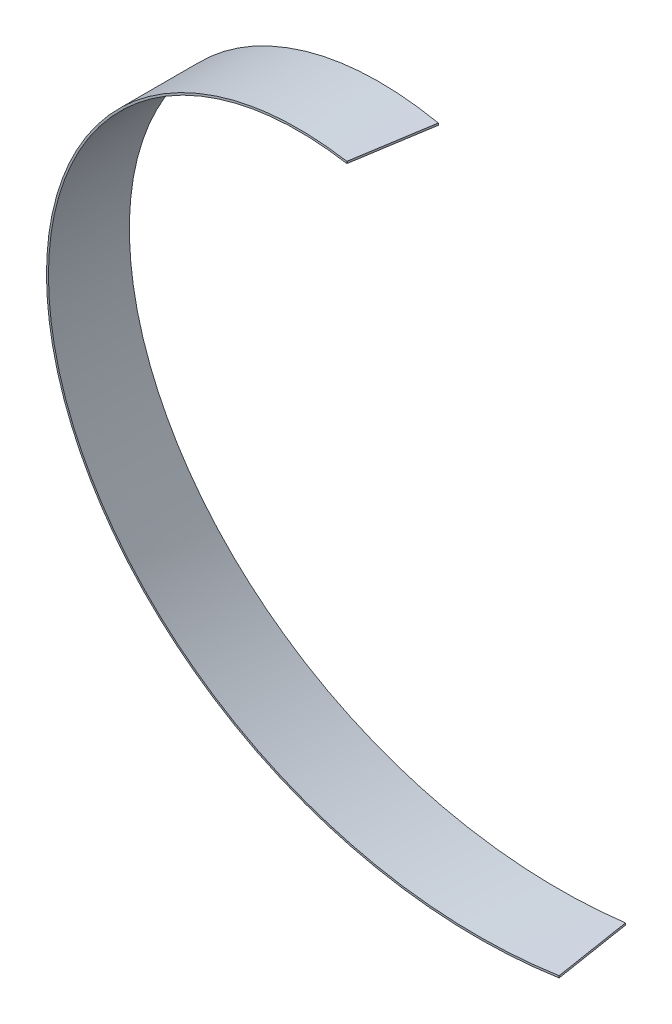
ISO-10303-21;
HEADER;
FILE_DESCRIPTION(('STEP AP214'),'2;1');
FILE_NAME('part.step','',(''),(''),'','','');
FILE_SCHEMA(('AUTOMOTIVE_DESIGN { 1 0 10303 214 1 1 1 1 }'));
ENDSEC;
DATA;
#1=APPLICATION_CONTEXT('core data for automotive mechanical design processes');
#2=APPLICATION_PROTOCOL_DEFINITION('international standard','automotive_design',2000,#1);
#3=PRODUCT_CONTEXT('',#1,'mechanical');
#4=PRODUCT('Part','Part','',(#3));
#5=PRODUCT_RELATED_PRODUCT_CATEGORY('part','',(#4));
#6=PRODUCT_DEFINITION_FORMATION('','',#4);
#7=PRODUCT_DEFINITION_CONTEXT('part definition',#1,'design');
#8=PRODUCT_DEFINITION('design','',#6,#7);
#9=PRODUCT_DEFINITION_SHAPE('','',#8);
#10=(LENGTH_UNIT() NAMED_UNIT(*) SI_UNIT(.MILLI.,.METRE.));
#11=(NAMED_UNIT(*) PLANE_ANGLE_UNIT() SI_UNIT($,.RADIAN.));
#12=(NAMED_UNIT(*) SI_UNIT($,.STERADIAN.) SOLID_ANGLE_UNIT());
#13=UNCERTAINTY_MEASURE_WITH_UNIT(LENGTH_MEASURE(1.E-05),#10,'distance_accuracy_value','');
#14=(GEOMETRIC_REPRESENTATION_CONTEXT(3) GLOBAL_UNCERTAINTY_ASSIGNED_CONTEXT((#13)) GLOBAL_UNIT_ASSIGNED_CONTEXT((#10,
#11,#12)) REPRESENTATION_CONTEXT('',''));
#15=CARTESIAN_POINT('',(0.,0.,0.));
#16=DIRECTION('',(0.,0.,1.));
#17=DIRECTION('',(1.,0.,0.));
#18=AXIS2_PLACEMENT_3D('',#15,#16,#17);
#19=CARTESIAN_POINT('',(-1.5717672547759,-99.75,-9.87570492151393));
#20=DIRECTION('',(-0.987570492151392,0.,0.15717672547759));
#21=DIRECTION('',(0.15717672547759,0.,0.987570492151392));
#22=AXIS2_PLACEMENT_3D('',#19,#20,#21);
#23=PLANE('',#22);
#24=DIRECTION('',(0.,1.,0.));
#25=VECTOR('',#24,1.);
#26=CARTESIAN_POINT('',(-1.5717672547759,-99.75,-9.87570492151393));
#27=LINE('',#26,#25);
#28=CARTESIAN_POINT('',(-1.5717672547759,-100.25,-9.87570492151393));
#29=VERTEX_POINT('',#28);
#30=CARTESIAN_POINT('',(-1.5717672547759,-99.75,-9.87570492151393));
#31=VERTEX_POINT('',#30);
#32=EDGE_CURVE('E73',#29,#31,#27,.T.);
#33=ORIENTED_EDGE('',*,*,#32,.T.);
#34=DIRECTION('',(0.15717672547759,0.,0.987570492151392));
#35=VECTOR('',#34,1.);
#36=CARTESIAN_POINT('',(-1.5717672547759,-99.75,-9.87570492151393));
#37=LINE('',#36,#35);
#38=CARTESIAN_POINT('',(1.5717672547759,-99.75,9.87570492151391));
#39=VERTEX_POINT('',#38);
#40=EDGE_CURVE('E68',#31,#39,#37,.T.);
#41=ORIENTED_EDGE('',*,*,#40,.T.);
#42=DIRECTION('',(0.,-1.,0.));
#43=VECTOR('',#42,1.);
#44=CARTESIAN_POINT('',(1.5717672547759,-99.75,9.87570492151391));
#45=LINE('',#44,#43);
#46=CARTESIAN_POINT('',(1.5717672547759,-100.25,9.87570492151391));
#47=VERTEX_POINT('',#46);
#48=EDGE_CURVE('E85',#39,#47,#45,.T.);
#49=ORIENTED_EDGE('',*,*,#48,.T.);
#50=DIRECTION('',(-0.15717672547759,0.,-0.987570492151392));
#51=VECTOR('',#50,1.);
#52=CARTESIAN_POINT('',(-1.5717672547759,-100.25,-9.87570492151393));
#53=LINE('',#52,#51);
#54=EDGE_CURVE('E78',#47,#29,#53,.T.);
#55=ORIENTED_EDGE('',*,*,#54,.T.);
#56=EDGE_LOOP('',(#33,#41,#49,#55));
#57=FACE_BOUND('',#56,.T.);
#58=ADVANCED_FACE('F33',(#57),#23,.F.);
#59=CARTESIAN_POINT('',(1.5717672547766,99.75,40.1242950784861));
#60=DIRECTION('',(0.987570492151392,0.,0.15717672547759));
#61=DIRECTION('',(-0.15717672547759,0.,0.987570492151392));
#62=AXIS2_PLACEMENT_3D('',#59,#60,#61);
#63=PLANE('',#62);
#64=DIRECTION('',(0.,-1.,0.));
#65=VECTOR('',#64,1.);
#66=CARTESIAN_POINT('',(1.5717672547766,99.75,40.1242950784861));
#67=LINE('',#66,#65);
#68=CARTESIAN_POINT('',(1.57176725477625,100.25,40.124295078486));
#69=VERTEX_POINT('',#68);
#70=CARTESIAN_POINT('',(1.57176725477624,99.75,40.124295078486));
#71=VERTEX_POINT('',#70);
#72=EDGE_CURVE('E47',#69,#71,#67,.T.);
#73=ORIENTED_EDGE('',*,*,#72,.F.);
#74=DIRECTION('',(0.15717672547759,0.,-0.987570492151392));
#75=VECTOR('',#74,1.);
#76=CARTESIAN_POINT('',(1.5717672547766,100.25,40.1242950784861));
#77=LINE('',#76,#75);
#78=CARTESIAN_POINT('',(-1.57176725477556,100.25,59.8757049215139));
#79=VERTEX_POINT('',#78);
#80=EDGE_CURVE('E56',#79,#69,#77,.T.);
#81=ORIENTED_EDGE('',*,*,#80,.F.);
#82=DIRECTION('',(0.,1.,0.));
#83=VECTOR('',#82,1.);
#84=CARTESIAN_POINT('',(-1.57176725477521,99.75,59.8757049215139));
#85=LINE('',#84,#83);
#86=CARTESIAN_POINT('',(-1.57176725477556,99.75,59.8757049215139));
#87=VERTEX_POINT('',#86);
#88=EDGE_CURVE('E93',#87,#79,#85,.T.);
#89=ORIENTED_EDGE('',*,*,#88,.F.);
#90=DIRECTION('',(-0.15717672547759,0.,0.987570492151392));
#91=VECTOR('',#90,1.);
#92=CARTESIAN_POINT('',(1.5717672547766,99.75,40.1242950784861));
#93=LINE('',#92,#91);
#94=EDGE_CURVE('E11',#71,#87,#93,.T.);
#95=ORIENTED_EDGE('',*,*,#94,.F.);
#96=EDGE_LOOP('',(#73,#81,#89,#95));
#97=FACE_BOUND('',#96,.T.);
#98=ADVANCED_FACE('F147',(#97),#63,.T.);
#99=CARTESIAN_POINT('',(1.5717672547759,-99.75,9.87570492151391));
#100=CARTESIAN_POINT('',(-18.269741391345,-100.062643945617,13.0007049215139));
#101=CARTESIAN_POINT('',(-36.7205487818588,-92.7584726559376,16.1257049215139));
#102=CARTESIAN_POINT('',(-55.1713561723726,-85.4543013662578,19.2507049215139));
#103=CARTESIAN_POINT('',(-69.4224941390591,-71.6453087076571,22.3757049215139));
#104=CARTESIAN_POINT('',(-83.6736321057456,-57.8363160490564,25.5007049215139));
#105=CARTESIAN_POINT('',(-91.5554940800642,-39.6247959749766,28.6257049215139));
#106=CARTESIAN_POINT('',(-99.4373560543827,-21.4132759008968,31.7507049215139));
#107=CARTESIAN_POINT('',(-99.75,-1.57176725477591,34.8757049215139));
#108=CARTESIAN_POINT('',(-100.062643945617,18.269741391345,38.0007049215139));
#109=CARTESIAN_POINT('',(-92.7584726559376,36.7205487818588,41.1257049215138));
#110=CARTESIAN_POINT('',(-85.4543013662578,55.1713561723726,44.2507049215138));
#111=CARTESIAN_POINT('',(-71.6453087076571,69.4224941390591,47.3757049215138));
#112=CARTESIAN_POINT('',(-57.8363160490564,83.6736321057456,50.5007049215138));
#113=CARTESIAN_POINT('',(-39.6247959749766,91.5554940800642,53.6257049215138));
#114=CARTESIAN_POINT('',(-21.4132759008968,99.4373560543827,56.7507049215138));
#115=CARTESIAN_POINT('',(-1.57176725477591,99.75,59.8757049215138));
#116=CARTESIAN_POINT('',(1.5717672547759,-100.25,9.87570492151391));
#117=CARTESIAN_POINT('',(-18.3691975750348,-100.562643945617,13.0007049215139));
#118=CARTESIAN_POINT('',(-36.9118904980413,-93.2204124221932,16.1257049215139));
#119=CARTESIAN_POINT('',(-55.4545834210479,-85.8781808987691,19.2507049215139));
#120=CARTESIAN_POINT('',(-69.7760475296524,-71.9988620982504,22.3757049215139));
#121=CARTESIAN_POINT('',(-84.0975116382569,-58.1195432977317,25.5007049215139));
#122=CARTESIAN_POINT('',(-92.0174338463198,-39.8161376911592,28.6257049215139));
#123=CARTESIAN_POINT('',(-99.9373560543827,-21.5127320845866,31.7507049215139));
#124=CARTESIAN_POINT('',(-100.25,-1.57176725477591,34.8757049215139));
#125=CARTESIAN_POINT('',(-100.562643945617,18.3691975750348,38.0007049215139));
#126=CARTESIAN_POINT('',(-93.2204124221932,36.9118904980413,41.1257049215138));
#127=CARTESIAN_POINT('',(-85.8781808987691,55.4545834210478,44.2507049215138));
#128=CARTESIAN_POINT('',(-71.9988620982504,69.7760475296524,47.3757049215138));
#129=CARTESIAN_POINT('',(-58.1195432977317,84.0975116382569,50.5007049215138));
#130=CARTESIAN_POINT('',(-39.8161376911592,92.0174338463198,53.6257049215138));
#131=CARTESIAN_POINT('',(-21.5127320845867,99.9373560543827,56.7507049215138));
#132=CARTESIAN_POINT('',(-1.57176725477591,100.25,59.8757049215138));
#133=(BOUNDED_SURFACE() B_SPLINE_SURFACE(1,2,((#99,#100,#101,#102,#103,#104,#105,#106,#107,#108,
#109,#110,#111,#112,#113,#114,#115),(#116,#117,#118,#119,#120,#121,#122,#123,#124,#125,#126,
#127,#128,#129,#130,#131,#132)),.UNSPECIFIED.,.F.,.F.,.F.) B_SPLINE_SURFACE_WITH_KNOTS((2,2),(3,
2,2,2,2,2,2,2,3),(0.,1.),(0.,0.125,0.25,0.375,0.5,0.625,0.75,0.875,1.),
.UNSPECIFIED.) GEOMETRIC_REPRESENTATION_ITEM() RATIONAL_B_SPLINE_SURFACE(((1.,0.98078528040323,
1.,0.98078528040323,1.,0.98078528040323,1.,0.98078528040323,1.,0.98078528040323,1.,
0.98078528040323,1.,0.98078528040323,1.,0.98078528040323,1.),(1.,0.98078528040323,1.,
0.98078528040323,1.,0.98078528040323,1.,0.98078528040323,1.,0.98078528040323,1.,
0.98078528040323,1.,0.98078528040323,1.,0.98078528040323,1.))) REPRESENTATION_ITEM('') SURFACE());
#134=CARTESIAN_POINT('',(1.5717672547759,-100.25,9.87570492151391));
#135=CARTESIAN_POINT('',(-18.3691975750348,-100.562643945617,13.0007049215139));
#136=CARTESIAN_POINT('',(-36.9118904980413,-93.2204124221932,16.1257049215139));
#137=CARTESIAN_POINT('',(-55.4545834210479,-85.8781808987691,19.2507049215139));
#138=CARTESIAN_POINT('',(-69.7760475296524,-71.9988620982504,22.3757049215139));
#139=CARTESIAN_POINT('',(-84.0975116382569,-58.1195432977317,25.5007049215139));
#140=CARTESIAN_POINT('',(-92.0174338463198,-39.8161376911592,28.6257049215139));
#141=CARTESIAN_POINT('',(-99.9373560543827,-21.5127320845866,31.7507049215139));
#142=CARTESIAN_POINT('',(-100.25,-1.57176725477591,34.8757049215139));
#143=CARTESIAN_POINT('',(-100.562643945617,18.3691975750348,38.0007049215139));
#144=CARTESIAN_POINT('',(-93.2204124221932,36.9118904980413,41.1257049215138));
#145=CARTESIAN_POINT('',(-85.8781808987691,55.4545834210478,44.2507049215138));
#146=CARTESIAN_POINT('',(-71.9988620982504,69.7760475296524,47.3757049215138));
#147=CARTESIAN_POINT('',(-58.1195432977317,84.0975116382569,50.5007049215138));
#148=CARTESIAN_POINT('',(-39.8161376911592,92.0174338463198,53.6257049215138));
#149=CARTESIAN_POINT('',(-21.5127320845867,99.9373560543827,56.7507049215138));
#150=CARTESIAN_POINT('',(-1.57176725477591,100.25,59.8757049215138));
#151=(BOUNDED_CURVE() B_SPLINE_CURVE(2,(#134,#135,#136,#137,#138,#139,#140,#141,#142,#143,#144,
#145,#146,#147,#148,#149,#150),.UNSPECIFIED.,.F.,.F.) B_SPLINE_CURVE_WITH_KNOTS((3,2,2,2,2,2,2,
2,3),(0.,0.125,0.25,0.375,0.5,0.625,0.75,0.875,1.),
.UNSPECIFIED.) CURVE() GEOMETRIC_REPRESENTATION_ITEM() RATIONAL_B_SPLINE_CURVE((1.,
0.98078528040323,1.,0.98078528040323,1.,0.98078528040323,1.,0.98078528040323,1.,
0.98078528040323,1.,0.98078528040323,1.,0.98078528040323,1.,0.98078528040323,1.)) REPRESENTATION_ITEM(''));
#152=EDGE_CURVE('E88',#47,#79,#151,.T.);
#153=CARTESIAN_POINT('',(1.5717672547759,-99.75,9.87570492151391));
#154=CARTESIAN_POINT('',(-18.269741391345,-100.062643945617,13.0007049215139));
#155=CARTESIAN_POINT('',(-36.7205487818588,-92.7584726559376,16.1257049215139));
#156=CARTESIAN_POINT('',(-55.1713561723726,-85.4543013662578,19.2507049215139));
#157=CARTESIAN_POINT('',(-69.4224941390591,-71.6453087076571,22.3757049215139));
#158=CARTESIAN_POINT('',(-83.6736321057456,-57.8363160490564,25.5007049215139));
#159=CARTESIAN_POINT('',(-91.5554940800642,-39.6247959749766,28.6257049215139));
#160=CARTESIAN_POINT('',(-99.4373560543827,-21.4132759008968,31.7507049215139));
#161=CARTESIAN_POINT('',(-99.75,-1.57176725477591,34.8757049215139));
#162=CARTESIAN_POINT('',(-100.062643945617,18.269741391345,38.0007049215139));
#163=CARTESIAN_POINT('',(-92.7584726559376,36.7205487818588,41.1257049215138));
#164=CARTESIAN_POINT('',(-85.4543013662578,55.1713561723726,44.2507049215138));
#165=CARTESIAN_POINT('',(-71.6453087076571,69.4224941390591,47.3757049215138));
#166=CARTESIAN_POINT('',(-57.8363160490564,83.6736321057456,50.5007049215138));
#167=CARTESIAN_POINT('',(-39.6247959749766,91.5554940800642,53.6257049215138));
#168=CARTESIAN_POINT('',(-21.4132759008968,99.4373560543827,56.7507049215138));
#169=CARTESIAN_POINT('',(-1.57176725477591,99.75,59.8757049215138));
#170=(BOUNDED_CURVE() B_SPLINE_CURVE(2,(#153,#154,#155,#156,#157,#158,#159,#160,#161,#162,#163,
#164,#165,#166,#167,#168,#169),.UNSPECIFIED.,.F.,.F.) B_SPLINE_CURVE_WITH_KNOTS((3,2,2,2,2,2,2,
2,3),(0.,0.125,0.25,0.375,0.5,0.625,0.75,0.875,1.),
.UNSPECIFIED.) CURVE() GEOMETRIC_REPRESENTATION_ITEM() RATIONAL_B_SPLINE_CURVE((1.,
0.98078528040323,1.,0.98078528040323,1.,0.98078528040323,1.,0.98078528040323,1.,
0.98078528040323,1.,0.98078528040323,1.,0.98078528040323,1.,0.98078528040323,1.)) REPRESENTATION_ITEM(''));
#171=EDGE_CURVE('E87',#39,#87,#170,.T.);
#172=ORIENTED_EDGE('',*,*,#152,.F.);
#173=ORIENTED_EDGE('',*,*,#48,.F.);
#174=ORIENTED_EDGE('',*,*,#171,.T.);
#175=ORIENTED_EDGE('',*,*,#88,.T.);
#176=EDGE_LOOP('',(#172,#173,#174,#175));
#177=FACE_BOUND('',#176,.T.);
#178=ADVANCED_FACE('F86',(#177),#133,.F.);
#179=CARTESIAN_POINT('',(1.5717672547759,-100.25,9.8757049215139));
#180=CARTESIAN_POINT('',(-18.3691975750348,-100.562643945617,13.0007049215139));
#181=CARTESIAN_POINT('',(-36.9118904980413,-93.2204124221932,16.1257049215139));
#182=CARTESIAN_POINT('',(-55.4545834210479,-85.8781808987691,19.2507049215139));
#183=CARTESIAN_POINT('',(-69.7760475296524,-71.9988620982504,22.3757049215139));
#184=CARTESIAN_POINT('',(-84.0975116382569,-58.1195432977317,25.5007049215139));
#185=CARTESIAN_POINT('',(-92.0174338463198,-39.8161376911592,28.6257049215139));
#186=CARTESIAN_POINT('',(-99.9373560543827,-21.5127320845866,31.7507049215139));
#187=CARTESIAN_POINT('',(-100.25,-1.57176725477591,34.8757049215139));
#188=CARTESIAN_POINT('',(-100.562643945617,18.3691975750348,38.0007049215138));
#189=CARTESIAN_POINT('',(-93.2204124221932,36.9118904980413,41.1257049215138));
#190=CARTESIAN_POINT('',(-85.8781808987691,55.4545834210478,44.2507049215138));
#191=CARTESIAN_POINT('',(-71.9988620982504,69.7760475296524,47.3757049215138));
#192=CARTESIAN_POINT('',(-58.1195432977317,84.0975116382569,50.5007049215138));
#193=CARTESIAN_POINT('',(-39.8161376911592,92.0174338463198,53.6257049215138));
#194=CARTESIAN_POINT('',(-21.5127320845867,99.9373560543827,56.7507049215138));
#195=CARTESIAN_POINT('',(-1.57176725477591,100.25,59.8757049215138));
#196=CARTESIAN_POINT('',(-1.5717672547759,-100.25,-9.87570492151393));
#197=CARTESIAN_POINT('',(-21.5127320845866,-99.9373560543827,-6.75070492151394));
#198=CARTESIAN_POINT('',(-39.8161376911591,-92.0174338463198,-3.62570492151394));
#199=CARTESIAN_POINT('',(-58.1195432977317,-84.0975116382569,-0.500704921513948));
#200=CARTESIAN_POINT('',(-71.9988620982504,-69.7760475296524,2.62429507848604));
#201=CARTESIAN_POINT('',(-85.8781808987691,-55.4545834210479,5.74929507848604));
#202=CARTESIAN_POINT('',(-93.2204124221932,-36.9118904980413,8.87429507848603));
#203=CARTESIAN_POINT('',(-100.562643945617,-18.3691975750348,11.999295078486));
#204=CARTESIAN_POINT('',(-100.25,1.5717672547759,15.124295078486));
#205=CARTESIAN_POINT('',(-99.9373560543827,21.5127320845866,18.249295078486));
#206=CARTESIAN_POINT('',(-92.0174338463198,39.8161376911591,21.374295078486));
#207=CARTESIAN_POINT('',(-84.0975116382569,58.1195432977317,24.499295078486));
#208=CARTESIAN_POINT('',(-69.7760475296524,71.9988620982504,27.624295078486));
#209=CARTESIAN_POINT('',(-55.4545834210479,85.8781808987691,30.749295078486));
#210=CARTESIAN_POINT('',(-36.9118904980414,93.2204124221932,33.874295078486));
#211=CARTESIAN_POINT('',(-18.3691975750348,100.562643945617,36.999295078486));
#212=CARTESIAN_POINT('',(1.57176725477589,100.25,40.124295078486));
#213=(BOUNDED_SURFACE() B_SPLINE_SURFACE(1,2,((#179,#180,#181,#182,#183,#184,#185,#186,#187,
#188,#189,#190,#191,#192,#193,#194,#195),(#196,#197,#198,#199,#200,#201,#202,#203,#204,#205,
#206,#207,#208,#209,#210,#211,#212)),.UNSPECIFIED.,.F.,.F.,.F.) B_SPLINE_SURFACE_WITH_KNOTS((2,
2),(3,2,2,2,2,2,2,2,3),(0.,1.),(0.,0.125,0.25,0.375,0.5,0.625,0.75,0.875,1.),
.UNSPECIFIED.) GEOMETRIC_REPRESENTATION_ITEM() RATIONAL_B_SPLINE_SURFACE(((1.,0.98078528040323,
1.,0.98078528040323,1.,0.98078528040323,1.,0.98078528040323,1.,0.98078528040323,1.,
0.98078528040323,1.,0.98078528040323,1.,0.98078528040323,1.),(1.,0.98078528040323,1.,
0.98078528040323,1.,0.98078528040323,1.,0.98078528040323,1.,0.98078528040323,1.,
0.98078528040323,1.,0.98078528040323,1.,0.98078528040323,1.))) REPRESENTATION_ITEM('') SURFACE());
#214=CARTESIAN_POINT('',(-1.5717672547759,-100.25,-9.87570492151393));
#215=CARTESIAN_POINT('',(-21.5127320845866,-99.9373560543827,-6.75070492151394));
#216=CARTESIAN_POINT('',(-39.8161376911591,-92.0174338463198,-3.62570492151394));
#217=CARTESIAN_POINT('',(-58.1195432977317,-84.0975116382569,-0.500704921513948));
#218=CARTESIAN_POINT('',(-71.9988620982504,-69.7760475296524,2.62429507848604));
#219=CARTESIAN_POINT('',(-85.8781808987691,-55.4545834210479,5.74929507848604));
#220=CARTESIAN_POINT('',(-93.2204124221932,-36.9118904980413,8.87429507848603));
#221=CARTESIAN_POINT('',(-100.562643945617,-18.3691975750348,11.999295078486));
#222=CARTESIAN_POINT('',(-100.25,1.5717672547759,15.124295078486));
#223=CARTESIAN_POINT('',(-99.9373560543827,21.5127320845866,18.249295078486));
#224=CARTESIAN_POINT('',(-92.0174338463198,39.8161376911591,21.374295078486));
#225=CARTESIAN_POINT('',(-84.0975116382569,58.1195432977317,24.499295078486));
#226=CARTESIAN_POINT('',(-69.7760475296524,71.9988620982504,27.624295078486));
#227=CARTESIAN_POINT('',(-55.4545834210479,85.8781808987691,30.749295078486));
#228=CARTESIAN_POINT('',(-36.9118904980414,93.2204124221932,33.874295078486));
#229=CARTESIAN_POINT('',(-18.3691975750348,100.562643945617,36.999295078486));
#230=CARTESIAN_POINT('',(1.57176725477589,100.25,40.124295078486));
#231=(BOUNDED_CURVE() B_SPLINE_CURVE(2,(#214,#215,#216,#217,#218,#219,#220,#221,#222,#223,#224,
#225,#226,#227,#228,#229,#230),.UNSPECIFIED.,.F.,.F.) B_SPLINE_CURVE_WITH_KNOTS((3,2,2,2,2,2,2,
2,3),(0.,0.125,0.25,0.375,0.5,0.625,0.75,0.875,1.),
.UNSPECIFIED.) CURVE() GEOMETRIC_REPRESENTATION_ITEM() RATIONAL_B_SPLINE_CURVE((1.,
0.98078528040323,1.,0.98078528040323,1.,0.98078528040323,1.,0.98078528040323,1.,
0.98078528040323,1.,0.98078528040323,1.,0.98078528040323,1.,0.98078528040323,1.)) REPRESENTATION_ITEM(''));
#232=EDGE_CURVE('E108',#29,#69,#231,.T.);
#233=ORIENTED_EDGE('',*,*,#232,.F.);
#234=ORIENTED_EDGE('',*,*,#54,.F.);
#235=ORIENTED_EDGE('',*,*,#152,.T.);
#236=ORIENTED_EDGE('',*,*,#80,.T.);
#237=EDGE_LOOP('',(#233,#234,#235,#236));
#238=FACE_BOUND('',#237,.T.);
#239=ADVANCED_FACE('F126',(#238),#213,.F.);
#240=CARTESIAN_POINT('',(-1.5717672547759,-100.25,-9.87570492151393));
#241=CARTESIAN_POINT('',(-21.5127320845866,-99.9373560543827,-6.75070492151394));
#242=CARTESIAN_POINT('',(-39.8161376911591,-92.0174338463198,-3.62570492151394));
#243=CARTESIAN_POINT('',(-58.1195432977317,-84.0975116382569,-0.500704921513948));
#244=CARTESIAN_POINT('',(-71.9988620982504,-69.7760475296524,2.62429507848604));
#245=CARTESIAN_POINT('',(-85.8781808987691,-55.4545834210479,5.74929507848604));
#246=CARTESIAN_POINT('',(-93.2204124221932,-36.9118904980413,8.87429507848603));
#247=CARTESIAN_POINT('',(-100.562643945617,-18.3691975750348,11.999295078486));
#248=CARTESIAN_POINT('',(-100.25,1.5717672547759,15.124295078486));
#249=CARTESIAN_POINT('',(-99.9373560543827,21.5127320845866,18.249295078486));
#250=CARTESIAN_POINT('',(-92.0174338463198,39.8161376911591,21.374295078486));
#251=CARTESIAN_POINT('',(-84.0975116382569,58.1195432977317,24.499295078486));
#252=CARTESIAN_POINT('',(-69.7760475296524,71.9988620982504,27.624295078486));
#253=CARTESIAN_POINT('',(-55.4545834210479,85.8781808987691,30.749295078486));
#254=CARTESIAN_POINT('',(-36.9118904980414,93.2204124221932,33.874295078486));
#255=CARTESIAN_POINT('',(-18.3691975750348,100.562643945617,36.999295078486));
#256=CARTESIAN_POINT('',(1.57176725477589,100.25,40.124295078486));
#257=CARTESIAN_POINT('',(-1.5717672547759,-99.75,-9.87570492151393));
#258=CARTESIAN_POINT('',(-21.4132759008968,-99.4373560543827,-6.75070492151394));
#259=CARTESIAN_POINT('',(-39.6247959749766,-91.5554940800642,-3.62570492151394));
#260=CARTESIAN_POINT('',(-57.8363160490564,-83.6736321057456,-0.50070492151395));
#261=CARTESIAN_POINT('',(-71.6453087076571,-69.4224941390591,2.62429507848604));
#262=CARTESIAN_POINT('',(-85.4543013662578,-55.1713561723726,5.74929507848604));
#263=CARTESIAN_POINT('',(-92.7584726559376,-36.7205487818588,8.87429507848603));
#264=CARTESIAN_POINT('',(-100.062643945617,-18.269741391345,11.999295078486));
#265=CARTESIAN_POINT('',(-99.75,1.5717672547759,15.124295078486));
#266=CARTESIAN_POINT('',(-99.4373560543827,21.4132759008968,18.249295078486));
#267=CARTESIAN_POINT('',(-91.5554940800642,39.6247959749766,21.374295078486));
#268=CARTESIAN_POINT('',(-83.6736321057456,57.8363160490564,24.499295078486));
#269=CARTESIAN_POINT('',(-69.4224941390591,71.6453087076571,27.624295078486));
#270=CARTESIAN_POINT('',(-55.1713561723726,85.4543013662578,30.749295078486));
#271=CARTESIAN_POINT('',(-36.7205487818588,92.7584726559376,33.874295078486));
#272=CARTESIAN_POINT('',(-18.269741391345,100.062643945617,36.999295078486));
#273=CARTESIAN_POINT('',(1.57176725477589,99.75,40.124295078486));
#274=(BOUNDED_SURFACE() B_SPLINE_SURFACE(1,2,((#240,#241,#242,#243,#244,#245,#246,#247,#248,
#249,#250,#251,#252,#253,#254,#255,#256),(#257,#258,#259,#260,#261,#262,#263,#264,#265,#266,
#267,#268,#269,#270,#271,#272,#273)),.UNSPECIFIED.,.F.,.F.,.F.) B_SPLINE_SURFACE_WITH_KNOTS((2,
2),(3,2,2,2,2,2,2,2,3),(0.,1.),(0.,0.125,0.25,0.375,0.5,0.625,0.75,0.875,1.),
.UNSPECIFIED.) GEOMETRIC_REPRESENTATION_ITEM() RATIONAL_B_SPLINE_SURFACE(((1.,0.98078528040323,
1.,0.98078528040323,1.,0.98078528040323,1.,0.98078528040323,1.,0.98078528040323,1.,
0.98078528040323,1.,0.98078528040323,1.,0.98078528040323,1.),(1.,0.98078528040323,1.,
0.98078528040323,1.,0.98078528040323,1.,0.98078528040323,1.,0.98078528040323,1.,
0.98078528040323,1.,0.98078528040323,1.,0.98078528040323,1.))) REPRESENTATION_ITEM('') SURFACE());
#275=CARTESIAN_POINT('',(-1.5717672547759,-99.75,-9.87570492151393));
#276=CARTESIAN_POINT('',(-21.4132759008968,-99.4373560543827,-6.75070492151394));
#277=CARTESIAN_POINT('',(-39.6247959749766,-91.5554940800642,-3.62570492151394));
#278=CARTESIAN_POINT('',(-57.8363160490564,-83.6736321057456,-0.50070492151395));
#279=CARTESIAN_POINT('',(-71.6453087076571,-69.4224941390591,2.62429507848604));
#280=CARTESIAN_POINT('',(-85.4543013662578,-55.1713561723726,5.74929507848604));
#281=CARTESIAN_POINT('',(-92.7584726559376,-36.7205487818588,8.87429507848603));
#282=CARTESIAN_POINT('',(-100.062643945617,-18.269741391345,11.999295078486));
#283=CARTESIAN_POINT('',(-99.75,1.5717672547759,15.124295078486));
#284=CARTESIAN_POINT('',(-99.4373560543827,21.4132759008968,18.249295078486));
#285=CARTESIAN_POINT('',(-91.5554940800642,39.6247959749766,21.374295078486));
#286=CARTESIAN_POINT('',(-83.6736321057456,57.8363160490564,24.499295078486));
#287=CARTESIAN_POINT('',(-69.4224941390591,71.6453087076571,27.624295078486));
#288=CARTESIAN_POINT('',(-55.1713561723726,85.4543013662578,30.749295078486));
#289=CARTESIAN_POINT('',(-36.7205487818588,92.7584726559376,33.874295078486));
#290=CARTESIAN_POINT('',(-18.269741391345,100.062643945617,36.999295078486));
#291=CARTESIAN_POINT('',(1.57176725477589,99.75,40.124295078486));
#292=(BOUNDED_CURVE() B_SPLINE_CURVE(2,(#275,#276,#277,#278,#279,#280,#281,#282,#283,#284,#285,
#286,#287,#288,#289,#290,#291),.UNSPECIFIED.,.F.,.F.) B_SPLINE_CURVE_WITH_KNOTS((3,2,2,2,2,2,2,
2,3),(0.,0.125,0.25,0.375,0.5,0.625,0.75,0.875,1.),
.UNSPECIFIED.) CURVE() GEOMETRIC_REPRESENTATION_ITEM() RATIONAL_B_SPLINE_CURVE((1.,
0.98078528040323,1.,0.98078528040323,1.,0.98078528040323,1.,0.98078528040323,1.,
0.98078528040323,1.,0.98078528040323,1.,0.98078528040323,1.,0.98078528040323,1.)) REPRESENTATION_ITEM(''));
#293=EDGE_CURVE('E40',#31,#71,#292,.T.);
#294=ORIENTED_EDGE('',*,*,#293,.F.);
#295=ORIENTED_EDGE('',*,*,#32,.F.);
#296=ORIENTED_EDGE('',*,*,#232,.T.);
#297=ORIENTED_EDGE('',*,*,#72,.T.);
#298=EDGE_LOOP('',(#294,#295,#296,#297));
#299=FACE_BOUND('',#298,.T.);
#300=ADVANCED_FACE('F124',(#299),#274,.F.);
#301=CARTESIAN_POINT('',(-1.5717672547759,-99.75,-9.87570492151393));
#302=CARTESIAN_POINT('',(-21.4132759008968,-99.4373560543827,-6.75070492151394));
#303=CARTESIAN_POINT('',(-39.6247959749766,-91.5554940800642,-3.62570492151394));
#304=CARTESIAN_POINT('',(-57.8363160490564,-83.6736321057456,-0.50070492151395));
#305=CARTESIAN_POINT('',(-71.6453087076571,-69.4224941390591,2.62429507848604));
#306=CARTESIAN_POINT('',(-85.4543013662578,-55.1713561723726,5.74929507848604));
#307=CARTESIAN_POINT('',(-92.7584726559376,-36.7205487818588,8.87429507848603));
#308=CARTESIAN_POINT('',(-100.062643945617,-18.269741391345,11.999295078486));
#309=CARTESIAN_POINT('',(-99.75,1.5717672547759,15.124295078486));
#310=CARTESIAN_POINT('',(-99.4373560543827,21.4132759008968,18.249295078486));
#311=CARTESIAN_POINT('',(-91.5554940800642,39.6247959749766,21.374295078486));
#312=CARTESIAN_POINT('',(-83.6736321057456,57.8363160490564,24.499295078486));
#313=CARTESIAN_POINT('',(-69.4224941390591,71.6453087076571,27.624295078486));
#314=CARTESIAN_POINT('',(-55.1713561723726,85.4543013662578,30.749295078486));
#315=CARTESIAN_POINT('',(-36.7205487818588,92.7584726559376,33.874295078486));
#316=CARTESIAN_POINT('',(-18.269741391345,100.062643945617,36.999295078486));
#317=CARTESIAN_POINT('',(1.57176725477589,99.75,40.124295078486));
#318=CARTESIAN_POINT('',(1.5717672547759,-99.75,9.87570492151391));
#319=CARTESIAN_POINT('',(-18.269741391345,-100.062643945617,13.0007049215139));
#320=CARTESIAN_POINT('',(-36.7205487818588,-92.7584726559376,16.1257049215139));
#321=CARTESIAN_POINT('',(-55.1713561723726,-85.4543013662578,19.2507049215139));
#322=CARTESIAN_POINT('',(-69.4224941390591,-71.6453087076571,22.3757049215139));
#323=CARTESIAN_POINT('',(-83.6736321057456,-57.8363160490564,25.5007049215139));
#324=CARTESIAN_POINT('',(-91.5554940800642,-39.6247959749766,28.6257049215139));
#325=CARTESIAN_POINT('',(-99.4373560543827,-21.4132759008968,31.7507049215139));
#326=CARTESIAN_POINT('',(-99.75,-1.57176725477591,34.8757049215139));
#327=CARTESIAN_POINT('',(-100.062643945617,18.269741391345,38.0007049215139));
#328=CARTESIAN_POINT('',(-92.7584726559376,36.7205487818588,41.1257049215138));
#329=CARTESIAN_POINT('',(-85.4543013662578,55.1713561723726,44.2507049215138));
#330=CARTESIAN_POINT('',(-71.6453087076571,69.4224941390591,47.3757049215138));
#331=CARTESIAN_POINT('',(-57.8363160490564,83.6736321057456,50.5007049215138));
#332=CARTESIAN_POINT('',(-39.6247959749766,91.5554940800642,53.6257049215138));
#333=CARTESIAN_POINT('',(-21.4132759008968,99.4373560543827,56.7507049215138));
#334=CARTESIAN_POINT('',(-1.57176725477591,99.75,59.8757049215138));
#335=(BOUNDED_SURFACE() B_SPLINE_SURFACE(1,2,((#301,#302,#303,#304,#305,#306,#307,#308,#309,
#310,#311,#312,#313,#314,#315,#316,#317),(#318,#319,#320,#321,#322,#323,#324,#325,#326,#327,
#328,#329,#330,#331,#332,#333,#334)),.UNSPECIFIED.,.F.,.F.,.F.) B_SPLINE_SURFACE_WITH_KNOTS((2,
2),(3,2,2,2,2,2,2,2,3),(0.,1.),(0.,0.125,0.25,0.375,0.5,0.625,0.75,0.875,1.),
.UNSPECIFIED.) GEOMETRIC_REPRESENTATION_ITEM() RATIONAL_B_SPLINE_SURFACE(((1.,0.98078528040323,
1.,0.98078528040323,1.,0.98078528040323,1.,0.98078528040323,1.,0.98078528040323,1.,
0.98078528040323,1.,0.98078528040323,1.,0.98078528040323,1.),(1.,0.98078528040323,1.,
0.98078528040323,1.,0.98078528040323,1.,0.98078528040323,1.,0.98078528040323,1.,
0.98078528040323,1.,0.98078528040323,1.,0.98078528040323,1.))) REPRESENTATION_ITEM('') SURFACE());
#336=ORIENTED_EDGE('',*,*,#94,.T.);
#337=ORIENTED_EDGE('',*,*,#171,.F.);
#338=ORIENTED_EDGE('',*,*,#40,.F.);
#339=ORIENTED_EDGE('',*,*,#293,.T.);
#340=EDGE_LOOP('',(#336,#337,#338,#339));
#341=FACE_BOUND('',#340,.T.);
#342=ADVANCED_FACE('F91',(#341),#335,.F.);
#343=CLOSED_SHELL('',(#58,#98,#178,#239,#300,#342));
#344=MANIFOLD_SOLID_BREP('B2',#343);
#345=ADVANCED_BREP_SHAPE_REPRESENTATION('',(#18,#344),#14);
#346=SHAPE_DEFINITION_REPRESENTATION(#9,#345);
ENDSEC;
END-ISO-10303-21;
